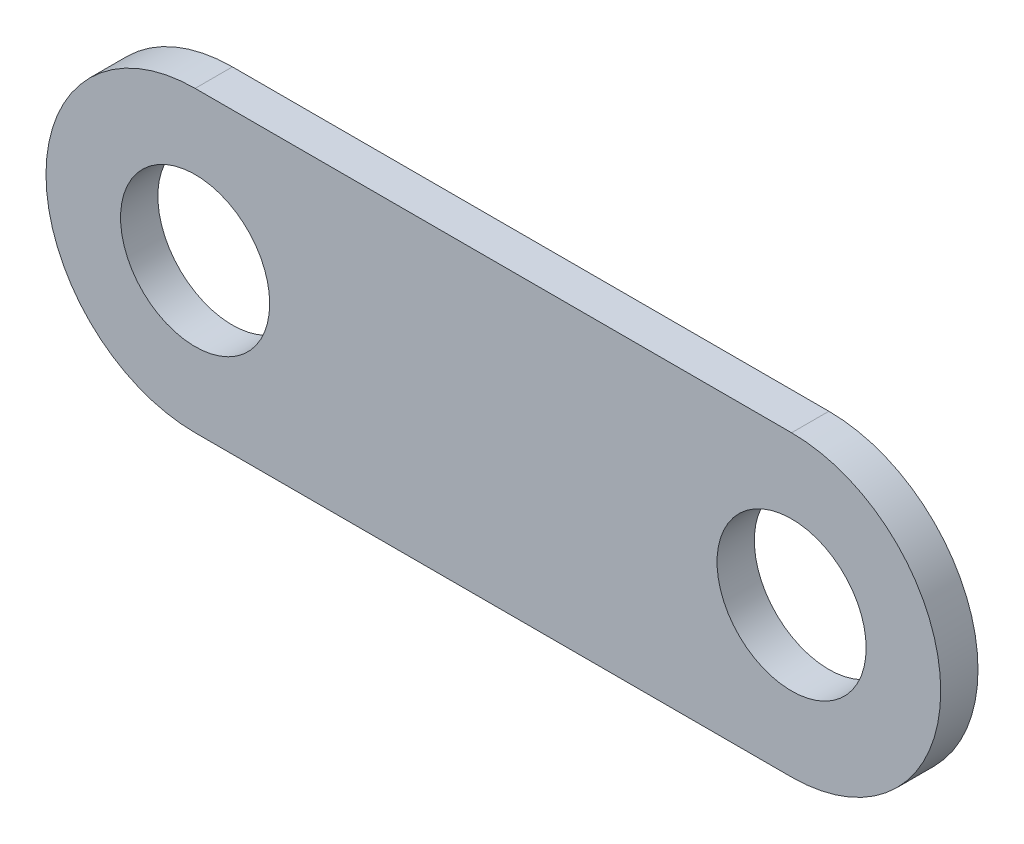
from build123d import *

# Parameters (mm, degrees)
EXTRUDE1_DEPTH     = 5
SKETCH2_R          = 10
CUT_EXTRUDE1_DEPTH = 75.858686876


with BuildPart() as part:
    # Sketch1 → Extrude1 (new body)
    with BuildSketch(Plane.XY):
        with BuildLine():
            Line((51.513050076, 21.557056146), (-28.486949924, 21.557056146))
            ThreePointArc((-28.486949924, 21.557056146), (-48.486949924, 1.557056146), (-28.486949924, -18.442943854))
            Line((-28.486949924, -18.442943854), (51.513050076, -18.442943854))
            ThreePointArc((51.513050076, -18.442943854), (71.513050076, 1.557056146), (51.513050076, 21.557056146))
        make_face()
    extrude(amount=EXTRUDE1_DEPTH)

    # Sketch2 → Cut-Extrude1 (cut, through all)
    with BuildSketch(Plane.XY.offset(5)):
        with Locations((-28.486949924, 1.557056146)):
            Circle(SKETCH2_R)
        with Locations((51.513050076, 1.557056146)):
            Circle(SKETCH2_R)
    extrude(amount=-CUT_EXTRUDE1_DEPTH, mode=Mode.SUBTRACT)


solid = part.part
